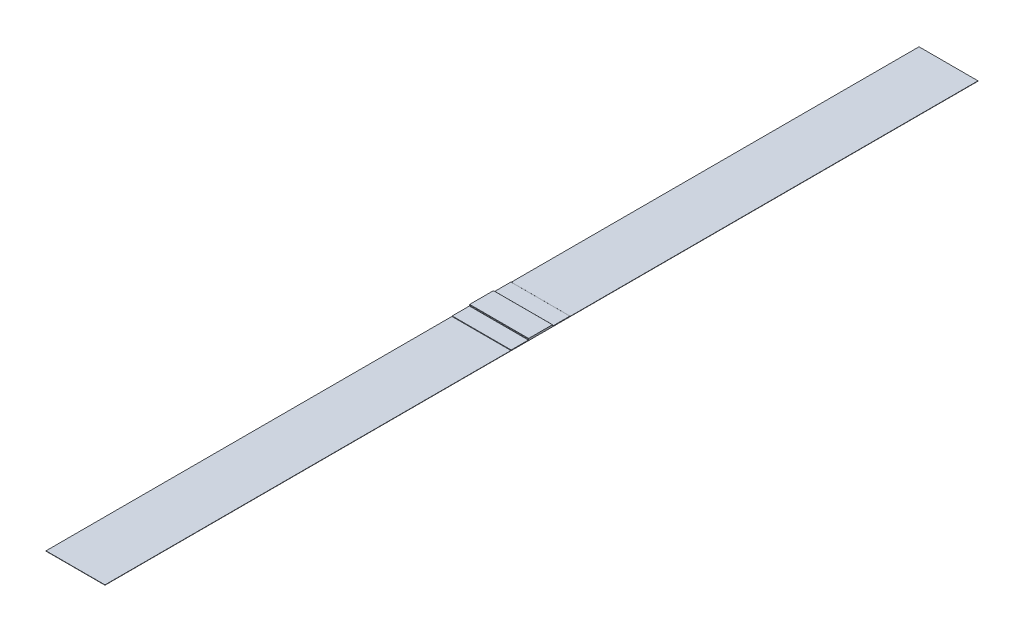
ISO-10303-21;
HEADER;
FILE_DESCRIPTION(('STEP AP214'),'2;1');
FILE_NAME('part.step','',(''),(''),'','','');
FILE_SCHEMA(('AUTOMOTIVE_DESIGN { 1 0 10303 214 1 1 1 1 }'));
ENDSEC;
DATA;
#1=APPLICATION_CONTEXT('core data for automotive mechanical design processes');
#2=APPLICATION_PROTOCOL_DEFINITION('international standard','automotive_design',2000,#1);
#3=PRODUCT_CONTEXT('',#1,'mechanical');
#4=PRODUCT('Part','Part','',(#3));
#5=PRODUCT_RELATED_PRODUCT_CATEGORY('part','',(#4));
#6=PRODUCT_DEFINITION_FORMATION('','',#4);
#7=PRODUCT_DEFINITION_CONTEXT('part definition',#1,'design');
#8=PRODUCT_DEFINITION('design','',#6,#7);
#9=PRODUCT_DEFINITION_SHAPE('','',#8);
#10=(LENGTH_UNIT() NAMED_UNIT(*) SI_UNIT(.MILLI.,.METRE.));
#11=(NAMED_UNIT(*) PLANE_ANGLE_UNIT() SI_UNIT($,.RADIAN.));
#12=(NAMED_UNIT(*) SI_UNIT($,.STERADIAN.) SOLID_ANGLE_UNIT());
#13=UNCERTAINTY_MEASURE_WITH_UNIT(LENGTH_MEASURE(1.E-05),#10,'distance_accuracy_value','');
#14=(GEOMETRIC_REPRESENTATION_CONTEXT(3) GLOBAL_UNCERTAINTY_ASSIGNED_CONTEXT((#13)) GLOBAL_UNIT_ASSIGNED_CONTEXT((#10,
#11,#12)) REPRESENTATION_CONTEXT('',''));
#15=CARTESIAN_POINT('',(0.,0.,0.));
#16=DIRECTION('',(0.,0.,1.));
#17=DIRECTION('',(1.,0.,0.));
#18=AXIS2_PLACEMENT_3D('',#15,#16,#17);
#19=CARTESIAN_POINT('',(0.,0.508,0.));
#20=DIRECTION('',(0.,1.,0.));
#21=DIRECTION('',(0.,0.,1.));
#22=AXIS2_PLACEMENT_3D('',#19,#20,#21);
#23=PLANE('',#22);
#24=DIRECTION('',(0.,0.,-1.));
#25=VECTOR('',#24,1.);
#26=CARTESIAN_POINT('',(66.675,0.508,0.));
#27=LINE('',#26,#25);
#28=CARTESIAN_POINT('',(66.675,0.508,-251.7775));
#29=VERTEX_POINT('',#28);
#30=CARTESIAN_POINT('',(66.675,0.508,-265.6205));
#31=VERTEX_POINT('',#30);
#32=EDGE_CURVE('E287',#29,#31,#27,.T.);
#33=ORIENTED_EDGE('',*,*,#32,.T.);
#34=DIRECTION('',(1.,0.,0.));
#35=VECTOR('',#34,1.);
#36=CARTESIAN_POINT('',(0.,0.508,-265.6205));
#37=LINE('',#36,#35);
#38=CARTESIAN_POINT('',(19.05,0.508,-265.6205));
#39=VERTEX_POINT('',#38);
#40=EDGE_CURVE('E253',#31,#39,#37,.F.);
#41=ORIENTED_EDGE('',*,*,#40,.T.);
#42=DIRECTION('',(0.,0.,1.));
#43=VECTOR('',#42,1.);
#44=CARTESIAN_POINT('',(19.05,0.508,0.));
#45=LINE('',#44,#43);
#46=CARTESIAN_POINT('',(19.05,0.508,-251.7775));
#47=VERTEX_POINT('',#46);
#48=EDGE_CURVE('E224',#39,#47,#45,.T.);
#49=ORIENTED_EDGE('',*,*,#48,.T.);
#50=DIRECTION('',(1.,0.,0.));
#51=VECTOR('',#50,1.);
#52=CARTESIAN_POINT('',(66.675,0.508,-251.7775));
#53=LINE('',#52,#51);
#54=EDGE_CURVE('E201',#47,#29,#53,.T.);
#55=ORIENTED_EDGE('',*,*,#54,.T.);
#56=EDGE_LOOP('',(#33,#41,#49,#55));
#57=FACE_BOUND('',#56,.T.);
#58=ADVANCED_FACE('F37',(#57),#23,.T.);
#59=CARTESIAN_POINT('',(19.05,0.508,-299.1485));
#60=VERTEX_POINT('',#59);
#61=CARTESIAN_POINT('',(19.05,0.508,-285.3055));
#62=VERTEX_POINT('',#61);
#63=EDGE_CURVE('E281',#60,#62,#45,.T.);
#64=ORIENTED_EDGE('',*,*,#63,.T.);
#65=DIRECTION('',(-1.,0.,0.));
#66=VECTOR('',#65,1.);
#67=CARTESIAN_POINT('',(0.,0.508,-285.3055));
#68=LINE('',#67,#66);
#69=CARTESIAN_POINT('',(66.675,0.508,-285.3055));
#70=VERTEX_POINT('',#69);
#71=EDGE_CURVE('E233',#62,#70,#68,.F.);
#72=ORIENTED_EDGE('',*,*,#71,.T.);
#73=CARTESIAN_POINT('',(66.675,0.508,-299.1485));
#74=VERTEX_POINT('',#73);
#75=EDGE_CURVE('E263',#70,#74,#27,.T.);
#76=ORIENTED_EDGE('',*,*,#75,.T.);
#77=DIRECTION('',(1.,0.,0.));
#78=VECTOR('',#77,1.);
#79=CARTESIAN_POINT('',(0.,0.508,-299.1485));
#80=LINE('',#79,#78);
#81=EDGE_CURVE('E204',#74,#60,#80,.F.);
#82=ORIENTED_EDGE('',*,*,#81,.T.);
#83=EDGE_LOOP('',(#64,#72,#76,#82));
#84=FACE_BOUND('',#83,.T.);
#85=ADVANCED_FACE('F284',(#84),#23,.T.);
#86=CARTESIAN_POINT('',(0.,0.254,0.));
#87=DIRECTION('',(0.,1.,0.));
#88=DIRECTION('',(0.,0.,1.));
#89=AXIS2_PLACEMENT_3D('',#86,#87,#88);
#90=PLANE('',#89);
#91=DIRECTION('',(0.,0.,-1.));
#92=VECTOR('',#91,1.);
#93=CARTESIAN_POINT('',(19.05,0.254,0.));
#94=LINE('',#93,#92);
#95=CARTESIAN_POINT('',(19.05,0.254,-299.4025));
#96=VERTEX_POINT('',#95);
#97=CARTESIAN_POINT('',(19.05,0.254,-628.65));
#98=VERTEX_POINT('',#97);
#99=EDGE_CURVE('E294',#96,#98,#94,.T.);
#100=ORIENTED_EDGE('',*,*,#99,.F.);
#101=DIRECTION('',(1.,0.,0.));
#102=VECTOR('',#101,1.);
#103=CARTESIAN_POINT('',(66.675,0.254,-299.4025));
#104=LINE('',#103,#102);
#105=CARTESIAN_POINT('',(66.675,0.254,-299.4025));
#106=VERTEX_POINT('',#105);
#107=EDGE_CURVE('E187',#96,#106,#104,.T.);
#108=ORIENTED_EDGE('',*,*,#107,.T.);
#109=DIRECTION('',(0.,0.,-1.));
#110=VECTOR('',#109,1.);
#111=CARTESIAN_POINT('',(66.675,0.254,0.));
#112=LINE('',#111,#110);
#113=CARTESIAN_POINT('',(66.675,0.254,-628.65));
#114=VERTEX_POINT('',#113);
#115=EDGE_CURVE('E173',#106,#114,#112,.T.);
#116=ORIENTED_EDGE('',*,*,#115,.T.);
#117=DIRECTION('',(1.,0.,0.));
#118=VECTOR('',#117,1.);
#119=CARTESIAN_POINT('',(0.,0.254,-628.65));
#120=LINE('',#119,#118);
#121=EDGE_CURVE('E172',#98,#114,#120,.T.);
#122=ORIENTED_EDGE('',*,*,#121,.F.);
#123=EDGE_LOOP('',(#100,#108,#116,#122));
#124=FACE_BOUND('',#123,.T.);
#125=ADVANCED_FACE('F317',(#124),#90,.T.);
#126=CARTESIAN_POINT('',(0.,0.254,76.2));
#127=DIRECTION('',(0.,0.,-1.));
#128=DIRECTION('',(-1.,0.,0.));
#129=AXIS2_PLACEMENT_3D('',#126,#127,#128);
#130=PLANE('',#129);
#131=DIRECTION('',(1.,0.,0.));
#132=VECTOR('',#131,1.);
#133=CARTESIAN_POINT('',(0.,0.,76.2));
#134=LINE('',#133,#132);
#135=CARTESIAN_POINT('',(19.05,0.,76.2));
#136=VERTEX_POINT('',#135);
#137=CARTESIAN_POINT('',(66.675,0.,76.2));
#138=VERTEX_POINT('',#137);
#139=EDGE_CURVE('E186',#136,#138,#134,.T.);
#140=ORIENTED_EDGE('',*,*,#139,.T.);
#141=DIRECTION('',(0.,-1.,0.));
#142=VECTOR('',#141,1.);
#143=CARTESIAN_POINT('',(66.675,0.254,76.2));
#144=LINE('',#143,#142);
#145=CARTESIAN_POINT('',(66.675,0.254,76.2));
#146=VERTEX_POINT('',#145);
#147=EDGE_CURVE('E166',#146,#138,#144,.T.);
#148=ORIENTED_EDGE('',*,*,#147,.F.);
#149=DIRECTION('',(1.,0.,0.));
#150=VECTOR('',#149,1.);
#151=CARTESIAN_POINT('',(0.,0.254,76.2));
#152=LINE('',#151,#150);
#153=CARTESIAN_POINT('',(19.05,0.254,76.2));
#154=VERTEX_POINT('',#153);
#155=EDGE_CURVE('E177',#154,#146,#152,.T.);
#156=ORIENTED_EDGE('',*,*,#155,.F.);
#157=DIRECTION('',(0.,-1.,0.));
#158=VECTOR('',#157,1.);
#159=CARTESIAN_POINT('',(19.05,0.254,76.2));
#160=LINE('',#159,#158);
#161=EDGE_CURVE('E296',#154,#136,#160,.T.);
#162=ORIENTED_EDGE('',*,*,#161,.T.);
#163=EDGE_LOOP('',(#140,#148,#156,#162));
#164=FACE_BOUND('',#163,.T.);
#165=ADVANCED_FACE('F184',(#164),#130,.F.);
#166=CARTESIAN_POINT('',(66.675,0.254,0.));
#167=DIRECTION('',(-1.,0.,0.));
#168=DIRECTION('',(0.,0.,1.));
#169=AXIS2_PLACEMENT_3D('',#166,#167,#168);
#170=PLANE('',#169);
#171=DIRECTION('',(0.,-1.,0.));
#172=VECTOR('',#171,1.);
#173=CARTESIAN_POINT('',(66.675,1.524,-285.1785));
#174=LINE('',#173,#172);
#175=CARTESIAN_POINT('',(66.675,1.397,-285.1785));
#176=VERTEX_POINT('',#175);
#177=CARTESIAN_POINT('',(66.675,0.635,-285.1785));
#178=VERTEX_POINT('',#177);
#179=EDGE_CURVE('E261',#176,#178,#174,.T.);
#180=ORIENTED_EDGE('',*,*,#179,.F.);
#181=CARTESIAN_POINT('',(66.675,1.397,-285.0515));
#182=DIRECTION('',(-1.,0.,0.));
#183=DIRECTION('',(0.,0.,1.));
#184=AXIS2_PLACEMENT_3D('',#181,#182,#183);
#185=CIRCLE('',#184,0.127);
#186=CARTESIAN_POINT('',(66.675,1.524,-285.0515));
#187=VERTEX_POINT('',#186);
#188=EDGE_CURVE('E247',#176,#187,#185,.F.);
#189=ORIENTED_EDGE('',*,*,#188,.T.);
#190=DIRECTION('',(0.,0.,-1.));
#191=VECTOR('',#190,1.);
#192=CARTESIAN_POINT('',(66.675,1.524,-265.7475));
#193=LINE('',#192,#191);
#194=CARTESIAN_POINT('',(66.675,1.524,-265.8745));
#195=VERTEX_POINT('',#194);
#196=EDGE_CURVE('E458',#195,#187,#193,.T.);
#197=ORIENTED_EDGE('',*,*,#196,.F.);
#198=CARTESIAN_POINT('',(66.675,1.397,-265.8745));
#199=DIRECTION('',(-1.,0.,0.));
#200=DIRECTION('',(0.,0.,1.));
#201=AXIS2_PLACEMENT_3D('',#198,#199,#200);
#202=CIRCLE('',#201,0.127);
#203=CARTESIAN_POINT('',(66.675,1.397,-265.7475));
#204=VERTEX_POINT('',#203);
#205=EDGE_CURVE('E245',#195,#204,#202,.F.);
#206=ORIENTED_EDGE('',*,*,#205,.T.);
#207=DIRECTION('',(0.,-1.,0.));
#208=VECTOR('',#207,1.);
#209=CARTESIAN_POINT('',(66.675,1.524,-265.7475));
#210=LINE('',#209,#208);
#211=CARTESIAN_POINT('',(66.675,0.635,-265.7475));
#212=VERTEX_POINT('',#211);
#213=EDGE_CURVE('E272',#204,#212,#210,.T.);
#214=ORIENTED_EDGE('',*,*,#213,.T.);
#215=CARTESIAN_POINT('',(66.675,0.635,-265.6205));
#216=DIRECTION('',(-1.,0.,0.));
#217=DIRECTION('',(0.,0.,1.));
#218=AXIS2_PLACEMENT_3D('',#215,#216,#217);
#219=CIRCLE('',#218,0.127);
#220=EDGE_CURVE('E45',#212,#31,#219,.T.);
#221=ORIENTED_EDGE('',*,*,#220,.T.);
#222=ORIENTED_EDGE('',*,*,#32,.F.);
#223=CARTESIAN_POINT('',(66.675,0.381,-251.7775));
#224=DIRECTION('',(-1.,0.,0.));
#225=DIRECTION('',(0.,0.,1.));
#226=AXIS2_PLACEMENT_3D('',#223,#224,#225);
#227=CIRCLE('',#226,0.127);
#228=CARTESIAN_POINT('',(66.675,0.381,-251.6505));
#229=VERTEX_POINT('',#228);
#230=EDGE_CURVE('E191',#29,#229,#227,.F.);
#231=ORIENTED_EDGE('',*,*,#230,.T.);
#232=CARTESIAN_POINT('',(66.675,0.381,-251.5235));
#233=DIRECTION('',(-1.,0.,0.));
#234=DIRECTION('',(0.,0.,1.));
#235=AXIS2_PLACEMENT_3D('',#232,#233,#234);
#236=CIRCLE('',#235,0.127);
#237=CARTESIAN_POINT('',(66.675,0.254,-251.5235));
#238=VERTEX_POINT('',#237);
#239=EDGE_CURVE('E169',#229,#238,#236,.T.);
#240=ORIENTED_EDGE('',*,*,#239,.T.);
#241=EDGE_CURVE('E160',#146,#238,#112,.T.);
#242=ORIENTED_EDGE('',*,*,#241,.F.);
#243=ORIENTED_EDGE('',*,*,#147,.T.);
#244=DIRECTION('',(0.,0.,-1.));
#245=VECTOR('',#244,1.);
#246=CARTESIAN_POINT('',(66.675,0.,0.));
#247=LINE('',#246,#245);
#248=CARTESIAN_POINT('',(66.675,0.,-628.65));
#249=VERTEX_POINT('',#248);
#250=EDGE_CURVE('E298',#138,#249,#247,.T.);
#251=ORIENTED_EDGE('',*,*,#250,.T.);
#252=DIRECTION('',(0.,-1.,0.));
#253=VECTOR('',#252,1.);
#254=CARTESIAN_POINT('',(66.675,0.254,-628.65));
#255=LINE('',#254,#253);
#256=EDGE_CURVE('E188',#114,#249,#255,.T.);
#257=ORIENTED_EDGE('',*,*,#256,.F.);
#258=ORIENTED_EDGE('',*,*,#115,.F.);
#259=CARTESIAN_POINT('',(66.675,0.381,-299.4025));
#260=DIRECTION('',(-1.,0.,0.));
#261=DIRECTION('',(0.,0.,1.));
#262=AXIS2_PLACEMENT_3D('',#259,#260,#261);
#263=CIRCLE('',#262,0.127);
#264=CARTESIAN_POINT('',(66.675,0.381,-299.2755));
#265=VERTEX_POINT('',#264);
#266=EDGE_CURVE('E213',#106,#265,#263,.T.);
#267=ORIENTED_EDGE('',*,*,#266,.T.);
#268=CARTESIAN_POINT('',(66.675,0.381,-299.1485));
#269=DIRECTION('',(-1.,0.,0.));
#270=DIRECTION('',(0.,0.,1.));
#271=AXIS2_PLACEMENT_3D('',#268,#269,#270);
#272=CIRCLE('',#271,0.127);
#273=EDGE_CURVE('E198',#265,#74,#272,.F.);
#274=ORIENTED_EDGE('',*,*,#273,.T.);
#275=ORIENTED_EDGE('',*,*,#75,.F.);
#276=CARTESIAN_POINT('',(66.675,0.635,-285.3055));
#277=DIRECTION('',(-1.,0.,0.));
#278=DIRECTION('',(0.,0.,1.));
#279=AXIS2_PLACEMENT_3D('',#276,#277,#278);
#280=CIRCLE('',#279,0.127);
#281=EDGE_CURVE('E257',#70,#178,#280,.T.);
#282=ORIENTED_EDGE('',*,*,#281,.T.);
#283=EDGE_LOOP('',(#180,#189,#197,#206,#214,#221,#222,#231,#240,#242,#243,#251,#257,#258,#267,
#274,#275,#282));
#284=FACE_BOUND('',#283,.T.);
#285=ADVANCED_FACE('F163',(#284),#170,.F.);
#286=CARTESIAN_POINT('',(0.,0.254,-628.65));
#287=DIRECTION('',(0.,0.,-1.));
#288=DIRECTION('',(-1.,0.,0.));
#289=AXIS2_PLACEMENT_3D('',#286,#287,#288);
#290=PLANE('',#289);
#291=DIRECTION('',(1.,0.,0.));
#292=VECTOR('',#291,1.);
#293=CARTESIAN_POINT('',(0.,0.,-628.65));
#294=LINE('',#293,#292);
#295=CARTESIAN_POINT('',(19.05,0.,-628.65));
#296=VERTEX_POINT('',#295);
#297=EDGE_CURVE('E300',#296,#249,#294,.T.);
#298=ORIENTED_EDGE('',*,*,#297,.F.);
#299=DIRECTION('',(0.,-1.,0.));
#300=VECTOR('',#299,1.);
#301=CARTESIAN_POINT('',(19.05,0.254,-628.65));
#302=LINE('',#301,#300);
#303=EDGE_CURVE('E193',#98,#296,#302,.T.);
#304=ORIENTED_EDGE('',*,*,#303,.F.);
#305=ORIENTED_EDGE('',*,*,#121,.T.);
#306=ORIENTED_EDGE('',*,*,#256,.T.);
#307=EDGE_LOOP('',(#298,#304,#305,#306));
#308=FACE_BOUND('',#307,.T.);
#309=ADVANCED_FACE('F311',(#308),#290,.T.);
#310=CARTESIAN_POINT('',(19.05,0.254,0.));
#311=DIRECTION('',(-1.,0.,0.));
#312=DIRECTION('',(0.,0.,1.));
#313=AXIS2_PLACEMENT_3D('',#310,#311,#312);
#314=PLANE('',#313);
#315=DIRECTION('',(0.,0.,1.));
#316=VECTOR('',#315,1.);
#317=CARTESIAN_POINT('',(19.05,1.524,-265.7475));
#318=LINE('',#317,#316);
#319=CARTESIAN_POINT('',(19.05,1.524,-285.0515));
#320=VERTEX_POINT('',#319);
#321=CARTESIAN_POINT('',(19.05,1.524,-265.8745));
#322=VERTEX_POINT('',#321);
#323=EDGE_CURVE('E461',#320,#322,#318,.T.);
#324=ORIENTED_EDGE('',*,*,#323,.F.);
#325=CARTESIAN_POINT('',(19.05,1.397,-285.0515));
#326=DIRECTION('',(-1.,0.,0.));
#327=DIRECTION('',(0.,0.,1.));
#328=AXIS2_PLACEMENT_3D('',#325,#326,#327);
#329=CIRCLE('',#328,0.127);
#330=CARTESIAN_POINT('',(19.05,1.397,-285.1785));
#331=VERTEX_POINT('',#330);
#332=EDGE_CURVE('E243',#320,#331,#329,.T.);
#333=ORIENTED_EDGE('',*,*,#332,.T.);
#334=DIRECTION('',(0.,-1.,0.));
#335=VECTOR('',#334,1.);
#336=CARTESIAN_POINT('',(19.05,1.524,-285.1785));
#337=LINE('',#336,#335);
#338=CARTESIAN_POINT('',(19.05,0.635,-285.1785));
#339=VERTEX_POINT('',#338);
#340=EDGE_CURVE('E273',#331,#339,#337,.T.);
#341=ORIENTED_EDGE('',*,*,#340,.T.);
#342=CARTESIAN_POINT('',(19.05,0.635,-285.3055));
#343=DIRECTION('',(-1.,0.,0.));
#344=DIRECTION('',(0.,0.,1.));
#345=AXIS2_PLACEMENT_3D('',#342,#343,#344);
#346=CIRCLE('',#345,0.127);
#347=EDGE_CURVE('E255',#339,#62,#346,.F.);
#348=ORIENTED_EDGE('',*,*,#347,.T.);
#349=ORIENTED_EDGE('',*,*,#63,.F.);
#350=CARTESIAN_POINT('',(19.05,0.381,-299.1485));
#351=DIRECTION('',(-1.,0.,0.));
#352=DIRECTION('',(0.,0.,1.));
#353=AXIS2_PLACEMENT_3D('',#350,#351,#352);
#354=CIRCLE('',#353,0.127);
#355=CARTESIAN_POINT('',(19.05,0.381,-299.2755));
#356=VERTEX_POINT('',#355);
#357=EDGE_CURVE('E209',#60,#356,#354,.T.);
#358=ORIENTED_EDGE('',*,*,#357,.T.);
#359=CARTESIAN_POINT('',(19.05,0.381,-299.4025));
#360=DIRECTION('',(-1.,0.,0.));
#361=DIRECTION('',(0.,0.,1.));
#362=AXIS2_PLACEMENT_3D('',#359,#360,#361);
#363=CIRCLE('',#362,0.127);
#364=EDGE_CURVE('E215',#356,#96,#363,.F.);
#365=ORIENTED_EDGE('',*,*,#364,.T.);
#366=ORIENTED_EDGE('',*,*,#99,.T.);
#367=ORIENTED_EDGE('',*,*,#303,.T.);
#368=DIRECTION('',(0.,0.,-1.));
#369=VECTOR('',#368,1.);
#370=CARTESIAN_POINT('',(19.05,0.,0.));
#371=LINE('',#370,#369);
#372=EDGE_CURVE('E182',#136,#296,#371,.T.);
#373=ORIENTED_EDGE('',*,*,#372,.F.);
#374=ORIENTED_EDGE('',*,*,#161,.F.);
#375=CARTESIAN_POINT('',(19.05,0.254,-251.5235));
#376=VERTEX_POINT('',#375);
#377=EDGE_CURVE('E180',#154,#376,#94,.T.);
#378=ORIENTED_EDGE('',*,*,#377,.T.);
#379=CARTESIAN_POINT('',(19.05,0.381,-251.5235));
#380=DIRECTION('',(-1.,0.,0.));
#381=DIRECTION('',(0.,0.,1.));
#382=AXIS2_PLACEMENT_3D('',#379,#380,#381);
#383=CIRCLE('',#382,0.127);
#384=CARTESIAN_POINT('',(19.05,0.381,-251.6505));
#385=VERTEX_POINT('',#384);
#386=EDGE_CURVE('E218',#376,#385,#383,.F.);
#387=ORIENTED_EDGE('',*,*,#386,.T.);
#388=CARTESIAN_POINT('',(19.05,0.381,-251.7775));
#389=DIRECTION('',(-1.,0.,0.));
#390=DIRECTION('',(0.,0.,1.));
#391=AXIS2_PLACEMENT_3D('',#388,#389,#390);
#392=CIRCLE('',#391,0.127);
#393=EDGE_CURVE('E206',#385,#47,#392,.T.);
#394=ORIENTED_EDGE('',*,*,#393,.T.);
#395=ORIENTED_EDGE('',*,*,#48,.F.);
#396=CARTESIAN_POINT('',(19.05,0.635,-265.6205));
#397=DIRECTION('',(-1.,0.,0.));
#398=DIRECTION('',(0.,0.,1.));
#399=AXIS2_PLACEMENT_3D('',#396,#397,#398);
#400=CIRCLE('',#399,0.127);
#401=CARTESIAN_POINT('',(19.05,0.635,-265.7475));
#402=VERTEX_POINT('',#401);
#403=EDGE_CURVE('E11',#39,#402,#400,.F.);
#404=ORIENTED_EDGE('',*,*,#403,.T.);
#405=DIRECTION('',(0.,-1.,0.));
#406=VECTOR('',#405,1.);
#407=CARTESIAN_POINT('',(19.05,1.524,-265.7475));
#408=LINE('',#407,#406);
#409=CARTESIAN_POINT('',(19.05,1.397,-265.7475));
#410=VERTEX_POINT('',#409);
#411=EDGE_CURVE('E228',#410,#402,#408,.T.);
#412=ORIENTED_EDGE('',*,*,#411,.F.);
#413=CARTESIAN_POINT('',(19.05,1.397,-265.8745));
#414=DIRECTION('',(-1.,0.,0.));
#415=DIRECTION('',(0.,0.,1.));
#416=AXIS2_PLACEMENT_3D('',#413,#414,#415);
#417=CIRCLE('',#416,0.127);
#418=EDGE_CURVE('E241',#410,#322,#417,.T.);
#419=ORIENTED_EDGE('',*,*,#418,.T.);
#420=EDGE_LOOP('',(#324,#333,#341,#348,#349,#358,#365,#366,#367,#373,#374,#378,#387,#394,#395,
#404,#412,#419));
#421=FACE_BOUND('',#420,.T.);
#422=ADVANCED_FACE('F280',(#421),#314,.T.);
#423=ORIENTED_EDGE('',*,*,#241,.T.);
#424=DIRECTION('',(1.,0.,0.));
#425=VECTOR('',#424,1.);
#426=CARTESIAN_POINT('',(0.,0.254,-251.5235));
#427=LINE('',#426,#425);
#428=EDGE_CURVE('E211',#238,#376,#427,.F.);
#429=ORIENTED_EDGE('',*,*,#428,.T.);
#430=ORIENTED_EDGE('',*,*,#377,.F.);
#431=ORIENTED_EDGE('',*,*,#155,.T.);
#432=EDGE_LOOP('',(#423,#429,#430,#431));
#433=FACE_BOUND('',#432,.T.);
#434=ADVANCED_FACE('F178',(#433),#90,.T.);
#435=CARTESIAN_POINT('',(0.,0.,0.));
#436=DIRECTION('',(0.,1.,0.));
#437=DIRECTION('',(0.,0.,1.));
#438=AXIS2_PLACEMENT_3D('',#435,#436,#437);
#439=PLANE('',#438);
#440=ORIENTED_EDGE('',*,*,#139,.F.);
#441=ORIENTED_EDGE('',*,*,#372,.T.);
#442=ORIENTED_EDGE('',*,*,#297,.T.);
#443=ORIENTED_EDGE('',*,*,#250,.F.);
#444=EDGE_LOOP('',(#440,#441,#442,#443));
#445=FACE_BOUND('',#444,.T.);
#446=ADVANCED_FACE('F314',(#445),#439,.F.);
#447=CARTESIAN_POINT('',(0.,0.381,-299.1485));
#448=DIRECTION('',(1.,0.,0.));
#449=DIRECTION('',(0.,0.,-1.));
#450=AXIS2_PLACEMENT_3D('',#447,#448,#449);
#451=CYLINDRICAL_SURFACE('',#450,0.127);
#452=DIRECTION('',(1.,0.,0.));
#453=VECTOR('',#452,1.);
#454=CARTESIAN_POINT('',(0.,0.381,-299.2755));
#455=LINE('',#454,#453);
#456=EDGE_CURVE('E221',#356,#265,#455,.T.);
#457=ORIENTED_EDGE('',*,*,#456,.F.);
#458=ORIENTED_EDGE('',*,*,#357,.F.);
#459=ORIENTED_EDGE('',*,*,#81,.F.);
#460=ORIENTED_EDGE('',*,*,#273,.F.);
#461=EDGE_LOOP('',(#457,#458,#459,#460));
#462=FACE_BOUND('',#461,.T.);
#463=ADVANCED_FACE('F325',(#462),#451,.T.);
#464=CARTESIAN_POINT('',(0.,0.381,-299.4025));
#465=DIRECTION('',(-1.,0.,0.));
#466=DIRECTION('',(0.,0.,1.));
#467=AXIS2_PLACEMENT_3D('',#464,#465,#466);
#468=CYLINDRICAL_SURFACE('',#467,0.127);
#469=ORIENTED_EDGE('',*,*,#364,.F.);
#470=ORIENTED_EDGE('',*,*,#456,.T.);
#471=ORIENTED_EDGE('',*,*,#266,.F.);
#472=ORIENTED_EDGE('',*,*,#107,.F.);
#473=EDGE_LOOP('',(#469,#470,#471,#472));
#474=FACE_BOUND('',#473,.T.);
#475=ADVANCED_FACE('F321',(#474),#468,.F.);
#476=CARTESIAN_POINT('',(0.,0.381,-251.5235));
#477=DIRECTION('',(1.,0.,0.));
#478=DIRECTION('',(0.,0.,-1.));
#479=AXIS2_PLACEMENT_3D('',#476,#477,#478);
#480=CYLINDRICAL_SURFACE('',#479,0.127);
#481=DIRECTION('',(1.,0.,0.));
#482=VECTOR('',#481,1.);
#483=CARTESIAN_POINT('',(0.,0.381,-251.6505));
#484=LINE('',#483,#482);
#485=EDGE_CURVE('E225',#385,#229,#484,.T.);
#486=ORIENTED_EDGE('',*,*,#485,.F.);
#487=ORIENTED_EDGE('',*,*,#386,.F.);
#488=ORIENTED_EDGE('',*,*,#428,.F.);
#489=ORIENTED_EDGE('',*,*,#239,.F.);
#490=EDGE_LOOP('',(#486,#487,#488,#489));
#491=FACE_BOUND('',#490,.T.);
#492=ADVANCED_FACE('F332',(#491),#480,.F.);
#493=CARTESIAN_POINT('',(0.,0.381,-251.7775));
#494=DIRECTION('',(-1.,0.,0.));
#495=DIRECTION('',(0.,0.,1.));
#496=AXIS2_PLACEMENT_3D('',#493,#494,#495);
#497=CYLINDRICAL_SURFACE('',#496,0.127);
#498=ORIENTED_EDGE('',*,*,#393,.F.);
#499=ORIENTED_EDGE('',*,*,#485,.T.);
#500=ORIENTED_EDGE('',*,*,#230,.F.);
#501=ORIENTED_EDGE('',*,*,#54,.F.);
#502=EDGE_LOOP('',(#498,#499,#500,#501));
#503=FACE_BOUND('',#502,.T.);
#504=ADVANCED_FACE('F393',(#503),#497,.T.);
#505=CARTESIAN_POINT('',(19.05,1.524,-265.7475));
#506=DIRECTION('',(0.,0.,-1.));
#507=DIRECTION('',(-1.,0.,0.));
#508=AXIS2_PLACEMENT_3D('',#505,#506,#507);
#509=PLANE('',#508);
#510=ORIENTED_EDGE('',*,*,#213,.F.);
#511=DIRECTION('',(1.,0.,0.));
#512=VECTOR('',#511,1.);
#513=CARTESIAN_POINT('',(19.05,1.397,-265.7475));
#514=LINE('',#513,#512);
#515=EDGE_CURVE('E251',#204,#410,#514,.F.);
#516=ORIENTED_EDGE('',*,*,#515,.T.);
#517=ORIENTED_EDGE('',*,*,#411,.T.);
#518=DIRECTION('',(1.,0.,0.));
#519=VECTOR('',#518,1.);
#520=CARTESIAN_POINT('',(19.05,0.635,-265.7475));
#521=LINE('',#520,#519);
#522=EDGE_CURVE('E249',#402,#212,#521,.T.);
#523=ORIENTED_EDGE('',*,*,#522,.T.);
#524=EDGE_LOOP('',(#510,#516,#517,#523));
#525=FACE_BOUND('',#524,.T.);
#526=ADVANCED_FACE('F344',(#525),#509,.F.);
#527=CARTESIAN_POINT('',(19.05,1.524,-285.1785));
#528=DIRECTION('',(0.,0.,1.));
#529=DIRECTION('',(1.,0.,0.));
#530=AXIS2_PLACEMENT_3D('',#527,#528,#529);
#531=PLANE('',#530);
#532=ORIENTED_EDGE('',*,*,#179,.T.);
#533=DIRECTION('',(-1.,0.,0.));
#534=VECTOR('',#533,1.);
#535=CARTESIAN_POINT('',(19.05,0.635,-285.1785));
#536=LINE('',#535,#534);
#537=EDGE_CURVE('E230',#178,#339,#536,.T.);
#538=ORIENTED_EDGE('',*,*,#537,.T.);
#539=ORIENTED_EDGE('',*,*,#340,.F.);
#540=DIRECTION('',(-1.,0.,0.));
#541=VECTOR('',#540,1.);
#542=CARTESIAN_POINT('',(19.05,1.397,-285.1785));
#543=LINE('',#542,#541);
#544=EDGE_CURVE('E220',#331,#176,#543,.F.);
#545=ORIENTED_EDGE('',*,*,#544,.T.);
#546=EDGE_LOOP('',(#532,#538,#539,#545));
#547=FACE_BOUND('',#546,.T.);
#548=ADVANCED_FACE('F268',(#547),#531,.F.);
#549=CARTESIAN_POINT('',(0.,1.524,0.));
#550=DIRECTION('',(0.,-1.,0.));
#551=DIRECTION('',(0.,0.,-1.));
#552=AXIS2_PLACEMENT_3D('',#549,#550,#551);
#553=PLANE('',#552);
#554=ORIENTED_EDGE('',*,*,#196,.T.);
#555=DIRECTION('',(-1.,0.,0.));
#556=VECTOR('',#555,1.);
#557=CARTESIAN_POINT('',(0.,1.524,-285.0515));
#558=LINE('',#557,#556);
#559=EDGE_CURVE('E238',#187,#320,#558,.T.);
#560=ORIENTED_EDGE('',*,*,#559,.T.);
#561=ORIENTED_EDGE('',*,*,#323,.T.);
#562=DIRECTION('',(1.,0.,0.));
#563=VECTOR('',#562,1.);
#564=CARTESIAN_POINT('',(0.,1.524,-265.8745));
#565=LINE('',#564,#563);
#566=EDGE_CURVE('E235',#322,#195,#565,.T.);
#567=ORIENTED_EDGE('',*,*,#566,.T.);
#568=EDGE_LOOP('',(#554,#560,#561,#567));
#569=FACE_BOUND('',#568,.T.);
#570=ADVANCED_FACE('F403',(#569),#553,.F.);
#571=CARTESIAN_POINT('',(19.05,0.635,-285.3055));
#572=DIRECTION('',(-1.,0.,0.));
#573=DIRECTION('',(0.,0.,1.));
#574=AXIS2_PLACEMENT_3D('',#571,#572,#573);
#575=CYLINDRICAL_SURFACE('',#574,0.127);
#576=ORIENTED_EDGE('',*,*,#281,.F.);
#577=ORIENTED_EDGE('',*,*,#71,.F.);
#578=ORIENTED_EDGE('',*,*,#347,.F.);
#579=ORIENTED_EDGE('',*,*,#537,.F.);
#580=EDGE_LOOP('',(#576,#577,#578,#579));
#581=FACE_BOUND('',#580,.T.);
#582=ADVANCED_FACE('F275',(#581),#575,.F.);
#583=CARTESIAN_POINT('',(0.,1.397,-285.0515));
#584=DIRECTION('',(-1.,0.,0.));
#585=DIRECTION('',(0.,0.,1.));
#586=AXIS2_PLACEMENT_3D('',#583,#584,#585);
#587=CYLINDRICAL_SURFACE('',#586,0.127);
#588=ORIENTED_EDGE('',*,*,#188,.F.);
#589=ORIENTED_EDGE('',*,*,#544,.F.);
#590=ORIENTED_EDGE('',*,*,#332,.F.);
#591=ORIENTED_EDGE('',*,*,#559,.F.);
#592=EDGE_LOOP('',(#588,#589,#590,#591));
#593=FACE_BOUND('',#592,.T.);
#594=ADVANCED_FACE('F420',(#593),#587,.T.);
#595=CARTESIAN_POINT('',(0.,1.397,-265.8745));
#596=DIRECTION('',(1.,0.,0.));
#597=DIRECTION('',(0.,0.,-1.));
#598=AXIS2_PLACEMENT_3D('',#595,#596,#597);
#599=CYLINDRICAL_SURFACE('',#598,0.127);
#600=ORIENTED_EDGE('',*,*,#418,.F.);
#601=ORIENTED_EDGE('',*,*,#515,.F.);
#602=ORIENTED_EDGE('',*,*,#205,.F.);
#603=ORIENTED_EDGE('',*,*,#566,.F.);
#604=EDGE_LOOP('',(#600,#601,#602,#603));
#605=FACE_BOUND('',#604,.T.);
#606=ADVANCED_FACE('F429',(#605),#599,.T.);
#607=CARTESIAN_POINT('',(19.05,0.635,-265.6205));
#608=DIRECTION('',(1.,0.,0.));
#609=DIRECTION('',(0.,0.,-1.));
#610=AXIS2_PLACEMENT_3D('',#607,#608,#609);
#611=CYLINDRICAL_SURFACE('',#610,0.127);
#612=ORIENTED_EDGE('',*,*,#403,.F.);
#613=ORIENTED_EDGE('',*,*,#40,.F.);
#614=ORIENTED_EDGE('',*,*,#220,.F.);
#615=ORIENTED_EDGE('',*,*,#522,.F.);
#616=EDGE_LOOP('',(#612,#613,#614,#615));
#617=FACE_BOUND('',#616,.T.);
#618=ADVANCED_FACE('F39',(#617),#611,.F.);
#619=CLOSED_SHELL('',(#58,#85,#125,#165,#285,#309,#422,#434,#446,#463,#475,#492,#504,#526,#548,
#570,#582,#594,#606,#618));
#620=MANIFOLD_SOLID_BREP('B2',#619);
#621=ADVANCED_BREP_SHAPE_REPRESENTATION('',(#18,#620),#14);
#622=SHAPE_DEFINITION_REPRESENTATION(#9,#621);
ENDSEC;
END-ISO-10303-21;
